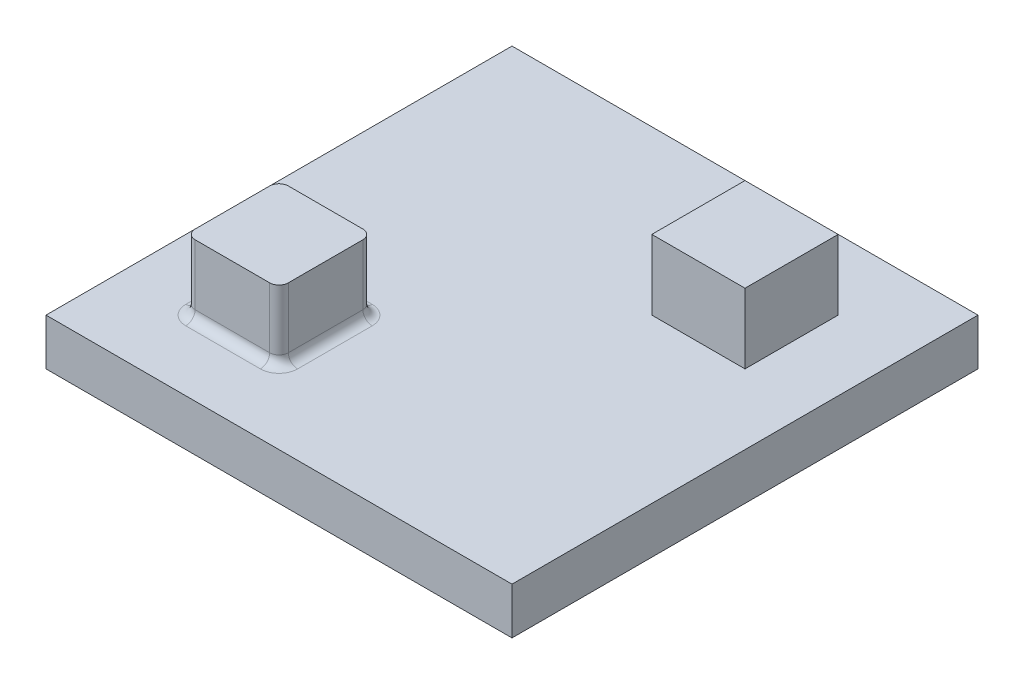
from build123d import *

# Parameters (mm, degrees)
SKETCH1_W      = 127
SKETCH1_H      = 127
EXTRUDE1_DEPTH = 12.7
SKETCH2_W      = 25.4
SKETCH2_H      = 25.4
EXTRUDE2_DEPTH = 19.05
FILLET1_R      = 2.54
SKETCH3_W      = 25.4
SKETCH3_H      = 25.4
EXTRUDE3_DEPTH = 19.05


with BuildPart() as part:
    # Sketch1 → Extrude1 (new body)
    with BuildSketch(Plane(origin=(0, 0, 0), x_dir=(1, 0, 0), z_dir=(0, 1, 0))):
        Rectangle(SKETCH1_W, SKETCH1_H)
    extrude(amount=EXTRUDE1_DEPTH)

    # Sketch2 → Extrude2 (add)
    with BuildSketch(Plane(origin=(0, 12.7, 0), x_dir=(-1, 0, 0), z_dir=(0, 1, 0))):
        with Locations((31.75, 31.75)):
            Rectangle(SKETCH2_W, SKETCH2_H)
    extrude(amount=EXTRUDE2_DEPTH)

    # Fillet1
    fillet1_edges = [part.edges().sort_by_distance(p)[0] for p in [
        (-19.05, 12.7, 31.75),
        (-19.05, 22.225, 44.45),
        (-31.75, 12.7, 19.05),
        (-19.05, 22.225, 19.05),
        (-44.45, 12.7, 31.75),
        (-44.45, 22.225, 19.05),
        (-31.75, 12.7, 44.45),
        (-44.45, 22.225, 44.45),
    ]]
    fillet(fillet1_edges, radius=FILLET1_R)

    # Sketch3 → Extrude3 (add)
    with BuildSketch(Plane(origin=(0, 12.7, 0), x_dir=(-1, 0, 0), z_dir=(0, 1, 0))):
        with Locations((-31.75, -31.75)):
            Rectangle(SKETCH3_W, SKETCH3_H)
    extrude(amount=EXTRUDE3_DEPTH)


solid = part.part
